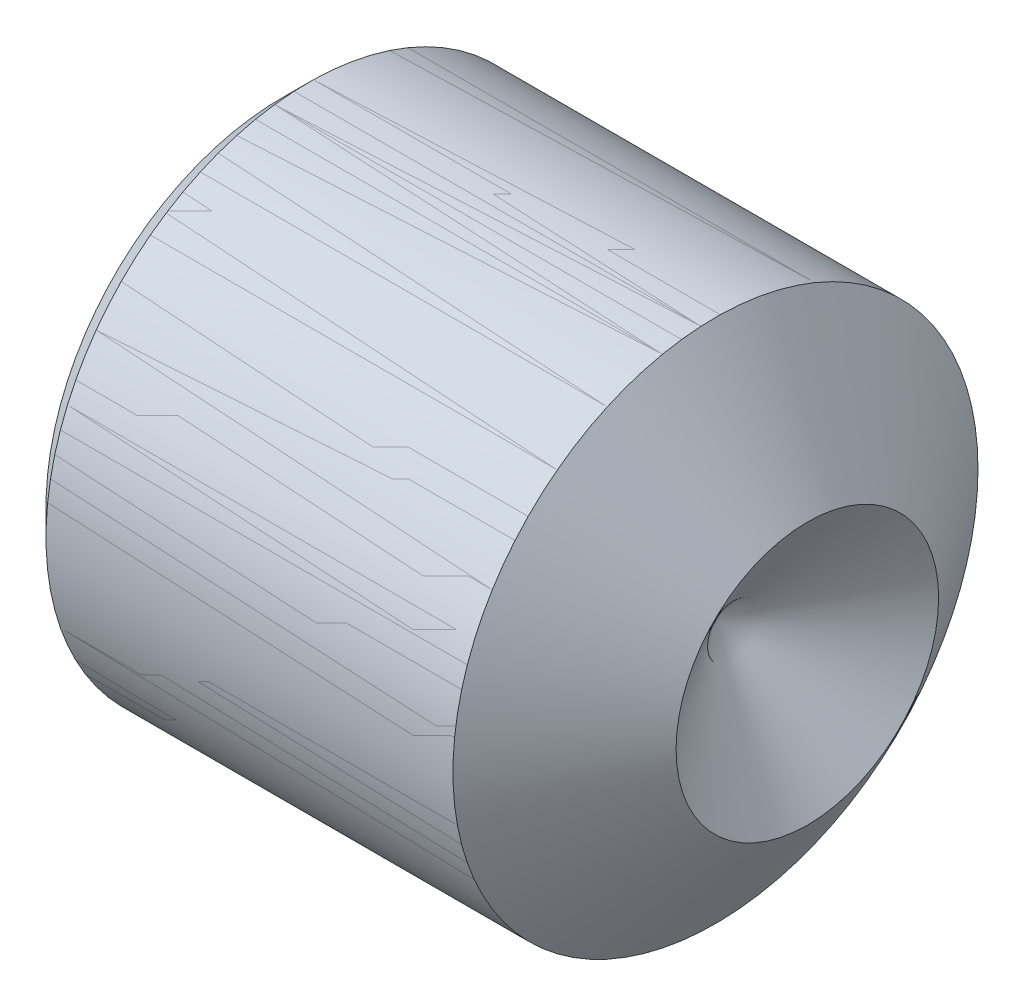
ISO-10303-21;
HEADER;
FILE_DESCRIPTION(('STEP AP214'),'2;1');
FILE_NAME('part.step','',(''),(''),'','','');
FILE_SCHEMA(('AUTOMOTIVE_DESIGN { 1 0 10303 214 1 1 1 1 }'));
ENDSEC;
DATA;
#1=APPLICATION_CONTEXT('core data for automotive mechanical design processes');
#2=APPLICATION_PROTOCOL_DEFINITION('international standard','automotive_design',2000,#1);
#3=PRODUCT_CONTEXT('',#1,'mechanical');
#4=PRODUCT('Part','Part','',(#3));
#5=PRODUCT_RELATED_PRODUCT_CATEGORY('part','',(#4));
#6=PRODUCT_DEFINITION_FORMATION('','',#4);
#7=PRODUCT_DEFINITION_CONTEXT('part definition',#1,'design');
#8=PRODUCT_DEFINITION('design','',#6,#7);
#9=PRODUCT_DEFINITION_SHAPE('','',#8);
#10=(LENGTH_UNIT() NAMED_UNIT(*) SI_UNIT(.MILLI.,.METRE.));
#11=(NAMED_UNIT(*) PLANE_ANGLE_UNIT() SI_UNIT($,.RADIAN.));
#12=(NAMED_UNIT(*) SI_UNIT($,.STERADIAN.) SOLID_ANGLE_UNIT());
#13=UNCERTAINTY_MEASURE_WITH_UNIT(LENGTH_MEASURE(1.E-05),#10,'distance_accuracy_value','');
#14=(GEOMETRIC_REPRESENTATION_CONTEXT(3) GLOBAL_UNCERTAINTY_ASSIGNED_CONTEXT((#13)) GLOBAL_UNIT_ASSIGNED_CONTEXT((#10,
#11,#12)) REPRESENTATION_CONTEXT('',''));
#15=CARTESIAN_POINT('',(0.,0.,0.));
#16=DIRECTION('',(0.,0.,1.));
#17=DIRECTION('',(1.,0.,0.));
#18=AXIS2_PLACEMENT_3D('',#15,#16,#17);
#19=CARTESIAN_POINT('',(-2.4,0.,0.));
#20=DIRECTION('',(1.,0.,0.));
#21=DIRECTION('',(0.,0.,-1.));
#22=AXIS2_PLACEMENT_3D('',#19,#20,#21);
#23=CYLINDRICAL_SURFACE('',#22,2.);
#24=CARTESIAN_POINT('',(1.3,0.,0.));
#25=DIRECTION('',(1.,0.,0.));
#26=DIRECTION('',(0.,0.,-1.));
#27=AXIS2_PLACEMENT_3D('',#24,#25,#26);
#28=CIRCLE('',#27,2.);
#29=CARTESIAN_POINT('',(1.3,0.,-2.));
#30=VERTEX_POINT('',#29);
#31=EDGE_CURVE('P0_E16',#30,#30,#28,.F.);
#32=ORIENTED_EDGE('',*,*,#31,.T.);
#33=EDGE_LOOP('',(#32));
#34=FACE_BOUND('',#33,.T.);
#35=CARTESIAN_POINT('',(-1.8,0.,0.));
#36=DIRECTION('',(1.,0.,0.));
#37=DIRECTION('',(0.,0.,-1.));
#38=AXIS2_PLACEMENT_3D('',#35,#36,#37);
#39=CIRCLE('',#38,2.);
#40=CARTESIAN_POINT('',(-1.8,0.,-2.));
#41=VERTEX_POINT('',#40);
#42=EDGE_CURVE('P0_E10',#41,#41,#39,.T.);
#43=ORIENTED_EDGE('',*,*,#42,.T.);
#44=EDGE_LOOP('',(#43));
#45=FACE_BOUND('',#44,.T.);
#46=ADVANCED_FACE('P0_F15',(#34,#45),#23,.T.);
#47=OPEN_SHELL('',(#46));
#48=SHELL_BASED_SURFACE_MODEL('P0_B1',(#47));
#49=CARTESIAN_POINT('',(0.25,-0.4330127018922,-0.25));
#50=DIRECTION('',(0.894427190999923,-0.38729833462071,-0.223606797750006));
#51=DIRECTION('',(0.397359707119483,0.91766293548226,0.));
#52=AXIS2_PLACEMENT_3D('',#49,#50,#51);
#53=PLANE('',#52);
#54=DIRECTION('',(0.397359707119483,0.91766293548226,0.));
#55=VECTOR('',#54,1.);
#56=CARTESIAN_POINT('',(0.30263157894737,-0.455802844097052,0.));
#57=LINE('',#56,#55);
#58=CARTESIAN_POINT('',(0.,-1.15470053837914,0.));
#59=VERTEX_POINT('',#58);
#60=CARTESIAN_POINT('',(0.499999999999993,0.,0.));
#61=VERTEX_POINT('',#60);
#62=EDGE_CURVE('P1_E114',#59,#61,#57,.T.);
#63=ORIENTED_EDGE('',*,*,#62,.T.);
#64=DIRECTION('',(-0.397359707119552,-0.458831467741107,-0.794719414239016));
#65=VECTOR('',#64,1.);
#66=CARTESIAN_POINT('',(0.500000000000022,0.,0.));
#67=LINE('',#66,#65);
#68=CARTESIAN_POINT('',(0.,-0.577350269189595,-0.999999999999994));
#69=VERTEX_POINT('',#68);
#70=EDGE_CURVE('P1_E95',#61,#69,#67,.T.);
#71=ORIENTED_EDGE('',*,*,#70,.T.);
#72=DIRECTION('',(0.,0.500000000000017,-0.866025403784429));
#73=VECTOR('',#72,1.);
#74=CARTESIAN_POINT('',(0.,-0.8660254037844,-0.5));
#75=LINE('',#74,#73);
#76=EDGE_CURVE('P1_E86',#69,#59,#75,.F.);
#77=ORIENTED_EDGE('',*,*,#76,.T.);
#78=EDGE_LOOP('',(#63,#71,#77));
#79=FACE_BOUND('',#78,.T.);
#80=ADVANCED_FACE('P1_F17',(#79),#53,.F.);
#81=CARTESIAN_POINT('',(0.25,-0.4330127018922,0.25));
#82=DIRECTION('',(0.894427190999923,-0.38729833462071,0.223606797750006));
#83=DIRECTION('',(0.397359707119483,0.91766293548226,0.));
#84=AXIS2_PLACEMENT_3D('',#81,#82,#83);
#85=PLANE('',#84);
#86=DIRECTION('',(0.397359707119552,0.458831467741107,-0.794719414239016));
#87=VECTOR('',#86,1.);
#88=CARTESIAN_POINT('',(0.,-0.5773502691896,0.999999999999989));
#89=LINE('',#88,#87);
#90=CARTESIAN_POINT('',(0.,-0.577350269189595,0.999999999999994));
#91=VERTEX_POINT('',#90);
#92=EDGE_CURVE('P1_E100',#91,#61,#89,.T.);
#93=ORIENTED_EDGE('',*,*,#92,.T.);
#94=ORIENTED_EDGE('',*,*,#62,.F.);
#95=DIRECTION('',(0.,-0.500000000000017,-0.866025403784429));
#96=VECTOR('',#95,1.);
#97=CARTESIAN_POINT('',(0.,-0.8660254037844,0.5));
#98=LINE('',#97,#96);
#99=EDGE_CURVE('P1_E98',#59,#91,#98,.F.);
#100=ORIENTED_EDGE('',*,*,#99,.T.);
#101=EDGE_LOOP('',(#93,#94,#100));
#102=FACE_BOUND('',#101,.T.);
#103=ADVANCED_FACE('P1_F191',(#102),#85,.F.);
#104=CARTESIAN_POINT('',(0.25,0.,-0.5));
#105=DIRECTION('',(0.894427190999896,0.,-0.447213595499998));
#106=DIRECTION('',(-0.447213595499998,0.,-0.894427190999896));
#107=AXIS2_PLACEMENT_3D('',#104,#105,#106);
#108=PLANE('',#107);
#109=ORIENTED_EDGE('',*,*,#70,.F.);
#110=DIRECTION('',(-0.397359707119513,0.458831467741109,-0.794719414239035));
#111=VECTOR('',#110,1.);
#112=CARTESIAN_POINT('',(0.499999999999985,0.,0.));
#113=LINE('',#112,#111);
#114=CARTESIAN_POINT('',(0.,0.577350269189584,-0.999999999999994));
#115=VERTEX_POINT('',#114);
#116=EDGE_CURVE('P1_E164',#61,#115,#113,.T.);
#117=ORIENTED_EDGE('',*,*,#116,.T.);
#118=DIRECTION('',(0.,1.,0.));
#119=VECTOR('',#118,1.);
#120=CARTESIAN_POINT('',(0.,0.,-1.));
#121=LINE('',#120,#119);
#122=EDGE_CURVE('P1_E163',#115,#69,#121,.F.);
#123=ORIENTED_EDGE('',*,*,#122,.T.);
#124=EDGE_LOOP('',(#109,#117,#123));
#125=FACE_BOUND('',#124,.T.);
#126=ADVANCED_FACE('P1_F189',(#125),#108,.F.);
#127=CARTESIAN_POINT('',(-1.,-0.8660254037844,-0.5));
#128=DIRECTION('',(0.,-0.866025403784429,-0.500000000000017));
#129=DIRECTION('',(0.,0.500000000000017,-0.866025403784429));
#130=AXIS2_PLACEMENT_3D('',#127,#128,#129);
#131=PLANE('',#130);
#132=ORIENTED_EDGE('',*,*,#76,.F.);
#133=DIRECTION('',(-1.,0.,0.));
#134=VECTOR('',#133,1.);
#135=CARTESIAN_POINT('',(-1.,-0.5773502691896,-1.));
#136=LINE('',#135,#134);
#137=CARTESIAN_POINT('',(-1.93470053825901,-0.577350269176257,-1.00000000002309));
#138=VERTEX_POINT('',#137);
#139=EDGE_CURVE('P1_E93',#69,#138,#136,.T.);
#140=ORIENTED_EDGE('',*,*,#139,.T.);
#141=CARTESIAN_POINT('',(-1.93470053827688,-1.15470053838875,4.71594179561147E-11));
#142=CARTESIAN_POINT('',(-1.9148758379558,-1.13485670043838,-0.0343705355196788));
#143=CARTESIAN_POINT('',(-1.89621557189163,-1.11468111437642,-0.0693156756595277));
#144=CARTESIAN_POINT('',(-1.86204941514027,-1.07354102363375,-0.140572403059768));
#145=CARTESIAN_POINT('',(-1.84656252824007,-1.05257260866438,-0.176890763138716));
#146=CARTESIAN_POINT('',(-1.82003357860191,-1.01029074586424,-0.250125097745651));
#147=CARTESIAN_POINT('',(-1.8089248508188,-0.988988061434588,-0.28702242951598));
#148=CARTESIAN_POINT('',(-1.79180902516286,-0.94591416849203,-0.361628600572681));
#149=CARTESIAN_POINT('',(-1.78578915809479,-0.924144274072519,-0.399335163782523));
#150=CARTESIAN_POINT('',(-1.78035942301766,-0.88662080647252,-0.464327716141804));
#151=CARTESIAN_POINT('',(-1.77955710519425,-0.870915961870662,-0.491529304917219));
#152=CARTESIAN_POINT('',(-1.78090931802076,-0.839536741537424,-0.545879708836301));
#153=CARTESIAN_POINT('',(-1.78306450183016,-0.823862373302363,-0.573028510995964));
#154=CARTESIAN_POINT('',(-1.79382385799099,-0.777063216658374,-0.654087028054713));
#155=CARTESIAN_POINT('',(-1.80672304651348,-0.746171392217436,-0.707593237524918));
#156=CARTESIAN_POINT('',(-1.83783821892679,-0.691975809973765,-0.801462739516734));
#157=CARTESIAN_POINT('',(-1.85441752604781,-0.668416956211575,-0.842267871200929));
#158=CARTESIAN_POINT('',(-1.89176182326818,-0.62222123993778,-0.922281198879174));
#159=CARTESIAN_POINT('',(-1.91251318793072,-0.599581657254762,-0.961494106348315));
#160=CARTESIAN_POINT('',(-1.93470053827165,-0.577350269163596,-1.000000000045));
#161=B_SPLINE_CURVE_WITH_KNOTS('',3,(#141,#142,#143,#144,#145,#146,#147,#148,#149,#150,#151,
#152,#153,#154,#155,#156,#157,#158,#159,#160),.UNSPECIFIED.,.F.,.F.,(4,2,2,2,2,2,2,2,2,4),(0.,
0.133182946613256,0.267141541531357,0.398973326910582,0.530473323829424,0.624596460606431,
0.718740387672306,0.907081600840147,1.05673041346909,1.20589820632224),.UNSPECIFIED.);
#162=CARTESIAN_POINT('',(-1.93470053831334,-1.15470053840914,-2.11683857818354E-11));
#163=VERTEX_POINT('',#162);
#164=EDGE_CURVE('P1_E20',#163,#138,#161,.T.);
#165=ORIENTED_EDGE('',*,*,#164,.F.);
#166=DIRECTION('',(1.,0.,0.));
#167=VECTOR('',#166,1.);
#168=CARTESIAN_POINT('',(-1.,-1.15470053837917,0.));
#169=LINE('',#168,#167);
#170=EDGE_CURVE('P1_E85',#163,#59,#169,.T.);
#171=ORIENTED_EDGE('',*,*,#170,.T.);
#172=EDGE_LOOP('',(#132,#140,#165,#171));
#173=FACE_BOUND('',#172,.T.);
#174=ADVANCED_FACE('P1_F90',(#173),#131,.F.);
#175=CARTESIAN_POINT('',(-1.,-0.8660254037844,0.5));
#176=DIRECTION('',(0.,-0.866025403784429,0.500000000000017));
#177=DIRECTION('',(0.,-0.500000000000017,-0.866025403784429));
#178=AXIS2_PLACEMENT_3D('',#175,#176,#177);
#179=PLANE('',#178);
#180=ORIENTED_EDGE('',*,*,#99,.F.);
#181=ORIENTED_EDGE('',*,*,#170,.F.);
#182=CARTESIAN_POINT('',(-1.93470053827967,-0.577350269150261,1.00000000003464));
#183=CARTESIAN_POINT('',(-1.91487583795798,-0.597194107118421,0.965629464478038));
#184=CARTESIAN_POINT('',(-1.89621557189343,-0.61736969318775,0.930684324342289));
#185=CARTESIAN_POINT('',(-1.86204941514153,-0.658509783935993,0.859427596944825));
#186=CARTESIAN_POINT('',(-1.84656252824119,-0.679478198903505,0.82310923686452));
#187=CARTESIAN_POINT('',(-1.82003357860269,-0.721760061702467,0.749874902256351));
#188=CARTESIAN_POINT('',(-1.80892485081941,-0.74306274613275,0.712977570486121));
#189=CARTESIAN_POINT('',(-1.79180902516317,-0.786136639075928,0.638371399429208));
#190=CARTESIAN_POINT('',(-1.78578915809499,-0.807906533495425,0.600664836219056));
#191=CARTESIAN_POINT('',(-1.78035942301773,-0.845430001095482,0.535672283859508));
#192=CARTESIAN_POINT('',(-1.77955710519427,-0.86113484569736,0.50847069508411));
#193=CARTESIAN_POINT('',(-1.78090931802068,-0.892514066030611,0.454120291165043));
#194=CARTESIAN_POINT('',(-1.78306450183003,-0.908188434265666,0.426971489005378));
#195=CARTESIAN_POINT('',(-1.79382385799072,-0.954987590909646,0.345912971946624));
#196=CARTESIAN_POINT('',(-1.80672304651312,-0.985879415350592,0.292406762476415));
#197=CARTESIAN_POINT('',(-1.83783821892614,-1.04007499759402,0.198537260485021));
#198=CARTESIAN_POINT('',(-1.85441752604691,-1.06363385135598,0.157732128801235));
#199=CARTESIAN_POINT('',(-1.8917618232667,-1.10982956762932,0.0777188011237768));
#200=CARTESIAN_POINT('',(-1.91251318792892,-1.13246915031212,0.0385058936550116));
#201=CARTESIAN_POINT('',(-1.93470053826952,-1.15470053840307,-4.13038790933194E-11));
#202=B_SPLINE_CURVE_WITH_KNOTS('',3,(#182,#183,#184,#185,#186,#187,#188,#189,#190,#191,#192,
#193,#194,#195,#196,#197,#198,#199,#200,#201),.UNSPECIFIED.,.F.,.F.,(4,2,2,2,2,2,2,2,2,4),(0.,
0.133182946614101,0.26714154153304,0.398973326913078,0.530473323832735,0.624596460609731,
0.718740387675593,0.907081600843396,1.05673041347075,1.20589820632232),.UNSPECIFIED.);
#203=CARTESIAN_POINT('',(-1.93470053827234,-0.577350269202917,1.00000000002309));
#204=VERTEX_POINT('',#203);
#205=EDGE_CURVE('P1_E74',#204,#163,#202,.T.);
#206=ORIENTED_EDGE('',*,*,#205,.F.);
#207=DIRECTION('',(1.,0.,0.));
#208=VECTOR('',#207,1.);
#209=CARTESIAN_POINT('',(-1.,-0.5773502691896,1.));
#210=LINE('',#209,#208);
#211=EDGE_CURVE('P1_E263',#204,#91,#210,.T.);
#212=ORIENTED_EDGE('',*,*,#211,.T.);
#213=EDGE_LOOP('',(#180,#181,#206,#212));
#214=FACE_BOUND('',#213,.T.);
#215=ADVANCED_FACE('P1_F97',(#214),#179,.F.);
#216=CARTESIAN_POINT('',(0.25,0.,0.5));
#217=DIRECTION('',(0.894427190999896,0.,0.447213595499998));
#218=DIRECTION('',(0.447213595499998,0.,-0.894427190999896));
#219=AXIS2_PLACEMENT_3D('',#216,#217,#218);
#220=PLANE('',#219);
#221=DIRECTION('',(0.397359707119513,-0.458831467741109,-0.794719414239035));
#222=VECTOR('',#221,1.);
#223=CARTESIAN_POINT('',(0.,0.577350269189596,0.999999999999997));
#224=LINE('',#223,#222);
#225=CARTESIAN_POINT('',(0.,0.577350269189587,0.99999999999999));
#226=VERTEX_POINT('',#225);
#227=EDGE_CURVE('P1_E255',#226,#61,#224,.T.);
#228=ORIENTED_EDGE('',*,*,#227,.T.);
#229=ORIENTED_EDGE('',*,*,#92,.F.);
#230=DIRECTION('',(0.,1.,0.));
#231=VECTOR('',#230,1.);
#232=CARTESIAN_POINT('',(0.,0.,1.));
#233=LINE('',#232,#231);
#234=EDGE_CURVE('P1_E260',#91,#226,#233,.T.);
#235=ORIENTED_EDGE('',*,*,#234,.T.);
#236=EDGE_LOOP('',(#228,#229,#235));
#237=FACE_BOUND('',#236,.T.);
#238=ADVANCED_FACE('P1_F180',(#237),#220,.F.);
#239=CARTESIAN_POINT('',(0.25,0.4330127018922,-0.25));
#240=DIRECTION('',(0.894427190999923,0.38729833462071,-0.223606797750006));
#241=DIRECTION('',(-0.397359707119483,0.91766293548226,0.));
#242=AXIS2_PLACEMENT_3D('',#239,#240,#241);
#243=PLANE('',#242);
#244=ORIENTED_EDGE('',*,*,#116,.F.);
#245=DIRECTION('',(-0.397359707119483,0.91766293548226,0.));
#246=VECTOR('',#245,1.);
#247=CARTESIAN_POINT('',(0.302631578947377,0.455802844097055,0.));
#248=LINE('',#247,#246);
#249=CARTESIAN_POINT('',(0.,1.15470053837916,0.));
#250=VERTEX_POINT('',#249);
#251=EDGE_CURVE('P1_E253',#61,#250,#248,.T.);
#252=ORIENTED_EDGE('',*,*,#251,.T.);
#253=DIRECTION('',(0.,0.500000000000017,0.866025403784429));
#254=VECTOR('',#253,1.);
#255=CARTESIAN_POINT('',(0.,0.8660254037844,-0.5));
#256=LINE('',#255,#254);
#257=EDGE_CURVE('P1_E242',#250,#115,#256,.F.);
#258=ORIENTED_EDGE('',*,*,#257,.T.);
#259=EDGE_LOOP('',(#244,#252,#258));
#260=FACE_BOUND('',#259,.T.);
#261=ADVANCED_FACE('P1_F174',(#260),#243,.F.);
#262=CARTESIAN_POINT('',(-1.,0.,-1.));
#263=DIRECTION('',(0.,0.,-1.));
#264=DIRECTION('',(-1.,0.,0.));
#265=AXIS2_PLACEMENT_3D('',#262,#263,#264);
#266=PLANE('',#265);
#267=ORIENTED_EDGE('',*,*,#122,.F.);
#268=DIRECTION('',(1.,0.,0.));
#269=VECTOR('',#268,1.);
#270=CARTESIAN_POINT('',(-1.,0.577350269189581,-0.999999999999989));
#271=LINE('',#270,#269);
#272=CARTESIAN_POINT('',(-1.93470053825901,0.577350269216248,-0.999999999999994));
#273=VERTEX_POINT('',#272);
#274=EDGE_CURVE('P1_E237',#115,#273,#271,.F.);
#275=ORIENTED_EDGE('',*,*,#274,.T.);
#276=CARTESIAN_POINT('',(-1.93470053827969,-0.577350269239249,-0.999999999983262));
#277=CARTESIAN_POINT('',(-1.91487583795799,-0.537662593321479,-0.999999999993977));
#278=CARTESIAN_POINT('',(-1.89621557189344,-0.497311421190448,-0.999999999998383));
#279=CARTESIAN_POINT('',(-1.86204941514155,-0.415031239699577,-1.00000000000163));
#280=CARTESIAN_POINT('',(-1.84656252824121,-0.373094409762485,-1.00000000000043));
#281=CARTESIAN_POINT('',(-1.82003357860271,-0.288530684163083,-0.999999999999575));
#282=CARTESIAN_POINT('',(-1.80892485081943,-0.245925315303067,-0.999999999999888));
#283=CARTESIAN_POINT('',(-1.7918090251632,-0.159777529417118,-1.00000000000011));
#284=CARTESIAN_POINT('',(-1.78578915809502,-0.11623774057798,-1.00000000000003));
#285=CARTESIAN_POINT('',(-1.78035942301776,-0.0411908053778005,-0.999999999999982));
#286=CARTESIAN_POINT('',(-1.7795571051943,-0.00978111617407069,-0.999999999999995));
#287=CARTESIAN_POINT('',(-1.78090931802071,0.0529773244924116,-1.00000000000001));
#288=CARTESIAN_POINT('',(-1.78306450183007,0.0843260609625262,-1.));
#289=CARTESIAN_POINT('',(-1.79382385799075,0.177924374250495,-0.999999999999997));
#290=CARTESIAN_POINT('',(-1.80672304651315,0.239708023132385,-0.999999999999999));
#291=CARTESIAN_POINT('',(-1.83783821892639,0.348099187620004,-1.));
#292=CARTESIAN_POINT('',(-1.85441752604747,0.395216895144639,-1.));
#293=CARTESIAN_POINT('',(-1.89176182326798,0.48760832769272,-1.));
#294=CARTESIAN_POINT('',(-1.91251318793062,0.532887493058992,-0.999999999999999));
#295=CARTESIAN_POINT('',(-1.93470053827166,0.577350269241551,-1.));
#296=B_SPLINE_CURVE_WITH_KNOTS('',3,(#276,#277,#278,#279,#280,#281,#282,#283,#284,#285,#286,
#287,#288,#289,#290,#291,#292,#293,#294,#295),.UNSPECIFIED.,.F.,.F.,(4,2,2,2,2,2,2,2,2,4),(0.,
0.133182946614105,0.267141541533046,0.398973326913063,0.530473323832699,0.624596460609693,
0.718740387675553,0.90708160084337,1.05673041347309,1.205898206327),.UNSPECIFIED.);
#297=EDGE_CURVE('P1_E158',#138,#273,#296,.T.);
#298=ORIENTED_EDGE('',*,*,#297,.F.);
#299=ORIENTED_EDGE('',*,*,#139,.F.);
#300=EDGE_LOOP('',(#267,#275,#298,#299));
#301=FACE_BOUND('',#300,.T.);
#302=ADVANCED_FACE('P1_F169',(#301),#266,.F.);
#303=CARTESIAN_POINT('',(-1.,0.,1.));
#304=DIRECTION('',(0.,0.,1.));
#305=DIRECTION('',(1.,0.,0.));
#306=AXIS2_PLACEMENT_3D('',#303,#304,#305);
#307=PLANE('',#306);
#308=ORIENTED_EDGE('',*,*,#234,.F.);
#309=ORIENTED_EDGE('',*,*,#211,.F.);
#310=CARTESIAN_POINT('',(-1.93470053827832,0.577350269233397,0.99999999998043));
#311=CARTESIAN_POINT('',(-1.91487583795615,0.537662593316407,0.999999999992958));
#312=CARTESIAN_POINT('',(-1.8962155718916,0.497311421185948,0.999999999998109));
#313=CARTESIAN_POINT('',(-1.86204941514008,0.415031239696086,1.0000000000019));
#314=CARTESIAN_POINT('',(-1.84656252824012,0.373094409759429,1.00000000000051));
#315=CARTESIAN_POINT('',(-1.82003357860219,0.288530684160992,0.999999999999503));
#316=CARTESIAN_POINT('',(-1.80892485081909,0.245925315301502,0.999999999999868));
#317=CARTESIAN_POINT('',(-1.79180902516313,0.159777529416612,1.00000000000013));
#318=CARTESIAN_POINT('',(-1.78578915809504,0.116237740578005,1.00000000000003));
#319=CARTESIAN_POINT('',(-1.78035942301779,0.0411908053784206,0.999999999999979));
#320=CARTESIAN_POINT('',(-1.77955710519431,0.00978111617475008,0.999999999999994));
#321=CARTESIAN_POINT('',(-1.78090931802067,-0.0529773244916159,1.00000000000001));
#322=CARTESIAN_POINT('',(-1.78306450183,-0.0843260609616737,1.));
#323=CARTESIAN_POINT('',(-1.79382385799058,-0.177924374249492,0.999999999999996));
#324=CARTESIAN_POINT('',(-1.8067230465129,-0.239708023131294,0.999999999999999));
#325=CARTESIAN_POINT('',(-1.83783821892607,-0.348099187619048,1.));
#326=CARTESIAN_POINT('',(-1.85441752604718,-0.395216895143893,1.));
#327=CARTESIAN_POINT('',(-1.89176182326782,-0.487608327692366,1.));
#328=CARTESIAN_POINT('',(-1.91251318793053,-0.532887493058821,0.999999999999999));
#329=CARTESIAN_POINT('',(-1.93470053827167,-0.577350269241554,1.));
#330=B_SPLINE_CURVE_WITH_KNOTS('',3,(#310,#311,#312,#313,#314,#315,#316,#317,#318,#319,#320,
#321,#322,#323,#324,#325,#326,#327,#328,#329),.UNSPECIFIED.,.F.,.F.,(4,2,2,2,2,2,2,2,2,4),(0.,
0.133182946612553,0.267141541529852,0.398973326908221,0.530473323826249,0.624596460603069,
0.718740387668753,0.907081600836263,1.05673041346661,1.20589820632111),.UNSPECIFIED.);
#331=CARTESIAN_POINT('',(-1.9347005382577,0.577350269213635,0.999999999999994));
#332=VERTEX_POINT('',#331);
#333=EDGE_CURVE('P1_E80',#332,#204,#330,.T.);
#334=ORIENTED_EDGE('',*,*,#333,.F.);
#335=DIRECTION('',(1.,0.,0.));
#336=VECTOR('',#335,1.);
#337=CARTESIAN_POINT('',(-1.,0.577350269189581,0.999999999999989));
#338=LINE('',#337,#336);
#339=EDGE_CURVE('P1_E234',#332,#226,#338,.T.);
#340=ORIENTED_EDGE('',*,*,#339,.T.);
#341=EDGE_LOOP('',(#308,#309,#334,#340));
#342=FACE_BOUND('',#341,.T.);
#343=ADVANCED_FACE('P1_F173',(#342),#307,.F.);
#344=CARTESIAN_POINT('',(0.25,0.4330127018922,0.25));
#345=DIRECTION('',(0.894427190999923,0.38729833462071,0.223606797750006));
#346=DIRECTION('',(-0.397359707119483,0.91766293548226,0.));
#347=AXIS2_PLACEMENT_3D('',#344,#345,#346);
#348=PLANE('',#347);
#349=ORIENTED_EDGE('',*,*,#251,.F.);
#350=ORIENTED_EDGE('',*,*,#227,.F.);
#351=DIRECTION('',(0.,-0.500000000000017,0.866025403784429));
#352=VECTOR('',#351,1.);
#353=CARTESIAN_POINT('',(0.,0.8660254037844,0.5));
#354=LINE('',#353,#352);
#355=EDGE_CURVE('P1_E231',#226,#250,#354,.F.);
#356=ORIENTED_EDGE('',*,*,#355,.T.);
#357=EDGE_LOOP('',(#349,#350,#356));
#358=FACE_BOUND('',#357,.T.);
#359=ADVANCED_FACE('P1_F289',(#358),#348,.F.);
#360=CARTESIAN_POINT('',(-1.,0.8660254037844,-0.5));
#361=DIRECTION('',(0.,0.866025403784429,-0.500000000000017));
#362=DIRECTION('',(0.,0.500000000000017,0.866025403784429));
#363=AXIS2_PLACEMENT_3D('',#360,#361,#362);
#364=PLANE('',#363);
#365=ORIENTED_EDGE('',*,*,#257,.F.);
#366=DIRECTION('',(1.,0.,0.));
#367=VECTOR('',#366,1.);
#368=CARTESIAN_POINT('',(-1.,1.15470053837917,0.));
#369=LINE('',#368,#367);
#370=CARTESIAN_POINT('',(-1.93470053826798,1.15470053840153,0.));
#371=VERTEX_POINT('',#370);
#372=EDGE_CURVE('P1_E134',#250,#371,#369,.F.);
#373=ORIENTED_EDGE('',*,*,#372,.T.);
#374=CARTESIAN_POINT('',(-1.93470053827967,0.577350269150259,-1.00000000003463));
#375=CARTESIAN_POINT('',(-1.91487583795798,0.597194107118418,-0.96562946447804));
#376=CARTESIAN_POINT('',(-1.89621557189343,0.617369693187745,-0.930684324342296));
#377=CARTESIAN_POINT('',(-1.86204941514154,0.658509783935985,-0.85942759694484));
#378=CARTESIAN_POINT('',(-1.8465625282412,0.679478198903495,-0.823109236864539));
#379=CARTESIAN_POINT('',(-1.8200335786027,0.721760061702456,-0.74987490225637));
#380=CARTESIAN_POINT('',(-1.80892485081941,0.743062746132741,-0.712977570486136));
#381=CARTESIAN_POINT('',(-1.79180902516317,0.786136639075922,-0.638371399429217));
#382=CARTESIAN_POINT('',(-1.78578915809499,0.807906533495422,-0.600664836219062));
#383=CARTESIAN_POINT('',(-1.78035942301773,0.845430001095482,-0.535672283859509));
#384=CARTESIAN_POINT('',(-1.77955710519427,0.86113484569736,-0.50847069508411));
#385=CARTESIAN_POINT('',(-1.78090931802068,0.892514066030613,-0.45412029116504));
#386=CARTESIAN_POINT('',(-1.78306450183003,0.908188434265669,-0.426971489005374));
#387=CARTESIAN_POINT('',(-1.79382385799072,0.954987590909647,-0.345912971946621));
#388=CARTESIAN_POINT('',(-1.80672304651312,0.985879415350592,-0.292406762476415));
#389=CARTESIAN_POINT('',(-1.83783821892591,1.04007499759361,-0.198537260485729));
#390=CARTESIAN_POINT('',(-1.85441752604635,1.06363385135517,-0.157732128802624));
#391=CARTESIAN_POINT('',(-1.89176182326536,1.10982956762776,-0.0777188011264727));
#392=CARTESIAN_POINT('',(-1.91251318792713,1.1324691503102,-0.0385058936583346));
#393=CARTESIAN_POINT('',(-1.93470053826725,1.15470053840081,3.7376755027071E-11));
#394=B_SPLINE_CURVE_WITH_KNOTS('',3,(#374,#375,#376,#377,#378,#379,#380,#381,#382,#383,#384,
#385,#386,#387,#388,#389,#390,#391,#392,#393),.UNSPECIFIED.,.F.,.F.,(4,2,2,2,2,2,2,2,2,4),(0.,
0.133182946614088,0.267141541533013,0.398973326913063,0.530473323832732,0.624596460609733,
0.718740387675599,0.907081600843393,1.05673041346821,1.20589820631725),.UNSPECIFIED.);
#395=EDGE_CURVE('P1_E135',#273,#371,#394,.T.);
#396=ORIENTED_EDGE('',*,*,#395,.F.);
#397=ORIENTED_EDGE('',*,*,#274,.F.);
#398=EDGE_LOOP('',(#365,#373,#396,#397));
#399=FACE_BOUND('',#398,.T.);
#400=ADVANCED_FACE('P1_F295',(#399),#364,.F.);
#401=CARTESIAN_POINT('',(-1.,0.8660254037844,0.5));
#402=DIRECTION('',(0.,0.866025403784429,0.500000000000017));
#403=DIRECTION('',(0.,-0.500000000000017,0.866025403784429));
#404=AXIS2_PLACEMENT_3D('',#401,#402,#403);
#405=PLANE('',#404);
#406=ORIENTED_EDGE('',*,*,#355,.F.);
#407=ORIENTED_EDGE('',*,*,#339,.F.);
#408=CARTESIAN_POINT('',(-1.9347005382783,0.577350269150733,1.00000000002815));
#409=CARTESIAN_POINT('',(-1.91487583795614,0.597194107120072,0.965629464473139));
#410=CARTESIAN_POINT('',(-1.89621557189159,0.617369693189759,0.930684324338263));
#411=CARTESIAN_POINT('',(-1.86204941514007,0.658509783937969,0.859427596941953));
#412=CARTESIAN_POINT('',(-1.84656252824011,0.679478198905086,0.823109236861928));
#413=CARTESIAN_POINT('',(-1.82003357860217,0.72176006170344,0.749874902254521));
#414=CARTESIAN_POINT('',(-1.80892485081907,0.743062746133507,0.712977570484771));
#415=CARTESIAN_POINT('',(-1.7918090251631,0.786136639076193,0.638371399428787));
#416=CARTESIAN_POINT('',(-1.78578915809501,0.807906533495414,0.600664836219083));
#417=CARTESIAN_POINT('',(-1.78035942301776,0.845430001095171,0.535672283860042));
#418=CARTESIAN_POINT('',(-1.77955710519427,0.861134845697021,0.508470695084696));
#419=CARTESIAN_POINT('',(-1.78090931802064,0.892514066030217,0.454120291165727));
#420=CARTESIAN_POINT('',(-1.78306450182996,0.908188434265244,0.42697148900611));
#421=CARTESIAN_POINT('',(-1.79382385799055,0.954987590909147,0.345912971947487));
#422=CARTESIAN_POINT('',(-1.80672304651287,0.985879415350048,0.292406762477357));
#423=CARTESIAN_POINT('',(-1.83783821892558,1.04007499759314,0.198537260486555));
#424=CARTESIAN_POINT('',(-1.85441752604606,1.0636338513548,0.157732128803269));
#425=CARTESIAN_POINT('',(-1.8917618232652,1.10982956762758,0.0777188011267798));
#426=CARTESIAN_POINT('',(-1.91251318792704,1.13246915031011,0.0385058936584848));
#427=CARTESIAN_POINT('',(-1.93470053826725,1.15470053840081,-3.73766403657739E-11));
#428=B_SPLINE_CURVE_WITH_KNOTS('',3,(#408,#409,#410,#411,#412,#413,#414,#415,#416,#417,#418,
#419,#420,#421,#422,#423,#424,#425,#426,#427),.UNSPECIFIED.,.F.,.F.,(4,2,2,2,2,2,2,2,2,4),(0.,
0.133182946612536,0.267141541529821,0.398973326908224,0.530473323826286,0.624596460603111,
0.718740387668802,0.907081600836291,1.05673041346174,1.20589820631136),.UNSPECIFIED.);
#429=EDGE_CURVE('P1_E127',#332,#371,#428,.T.);
#430=ORIENTED_EDGE('',*,*,#429,.T.);
#431=ORIENTED_EDGE('',*,*,#372,.F.);
#432=EDGE_LOOP('',(#406,#407,#430,#431));
#433=FACE_BOUND('',#432,.T.);
#434=ADVANCED_FACE('P1_F141',(#433),#405,.F.);
#435=CARTESIAN_POINT('',(-1.99999999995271,0.,0.));
#436=DIRECTION('',(-1.,0.,0.));
#437=DIRECTION('',(0.,0.,1.));
#438=AXIS2_PLACEMENT_3D('',#435,#436,#437);
#439=CONICAL_SURFACE('',#438,1.22000000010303,0.785398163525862);
#440=ORIENTED_EDGE('',*,*,#205,.T.);
#441=ORIENTED_EDGE('',*,*,#164,.T.);
#442=ORIENTED_EDGE('',*,*,#297,.T.);
#443=ORIENTED_EDGE('',*,*,#395,.T.);
#444=ORIENTED_EDGE('',*,*,#429,.F.);
#445=ORIENTED_EDGE('',*,*,#333,.T.);
#446=EDGE_LOOP('',(#440,#441,#442,#443,#444,#445));
#447=FACE_BOUND('',#446,.T.);
#448=CARTESIAN_POINT('',(-1.99999999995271,0.,0.));
#449=DIRECTION('',(-1.,0.,0.));
#450=DIRECTION('',(0.,0.,1.));
#451=AXIS2_PLACEMENT_3D('',#448,#449,#450);
#452=CIRCLE('',#451,1.22000000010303);
#453=CARTESIAN_POINT('',(-1.99999999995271,0.,1.22000000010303));
#454=VERTEX_POINT('',#453);
#455=EDGE_CURVE('P1_E124',#454,#454,#452,.T.);
#456=ORIENTED_EDGE('',*,*,#455,.T.);
#457=EDGE_LOOP('',(#456));
#458=FACE_BOUND('',#457,.T.);
#459=ADVANCED_FACE('P1_F76',(#447,#458),#439,.F.);
#460=CARTESIAN_POINT('',(-2.,0.,0.));
#461=DIRECTION('',(1.,0.,0.));
#462=DIRECTION('',(0.,0.,-1.));
#463=AXIS2_PLACEMENT_3D('',#460,#461,#462);
#464=PLANE('',#463);
#465=ORIENTED_EDGE('',*,*,#455,.F.);
#466=EDGE_LOOP('',(#465));
#467=FACE_BOUND('',#466,.T.);
#468=CARTESIAN_POINT('',(-1.99999999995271,0.,0.));
#469=DIRECTION('',(1.,0.,0.));
#470=DIRECTION('',(0.,0.,-1.));
#471=AXIS2_PLACEMENT_3D('',#468,#469,#470);
#472=CIRCLE('',#471,1.80000000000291);
#473=CARTESIAN_POINT('',(-1.99999999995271,0.,-1.80000000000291));
#474=VERTEX_POINT('',#473);
#475=EDGE_CURVE('P1_E120',#474,#474,#472,.T.);
#476=ORIENTED_EDGE('',*,*,#475,.F.);
#477=EDGE_LOOP('',(#476));
#478=FACE_BOUND('',#477,.T.);
#479=ADVANCED_FACE('P1_F146',(#467,#478),#464,.F.);
#480=CARTESIAN_POINT('',(1.99999999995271,0.,0.));
#481=DIRECTION('',(1.,0.,0.));
#482=DIRECTION('',(0.,0.,-1.));
#483=AXIS2_PLACEMENT_3D('',#480,#481,#482);
#484=CONICAL_SURFACE('',#483,0.99999999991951,0.960070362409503);
#485=CARTESIAN_POINT('',(1.30000000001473,1.4210854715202E-10,0.));
#486=VERTEX_POINT('',#485);
#487=VERTEX_LOOP('',#486);
#488=FACE_BOUND('',#487,.T.);
#489=CARTESIAN_POINT('',(2.00000000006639,0.,0.));
#490=DIRECTION('',(-1.,0.,0.));
#491=DIRECTION('',(0.,1.,0.));
#492=AXIS2_PLACEMENT_3D('',#489,#490,#491);
#493=CIRCLE('',#492,0.999999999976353);
#494=CARTESIAN_POINT('',(2.00000000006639,0.999999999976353,0.));
#495=VERTEX_POINT('',#494);
#496=EDGE_CURVE('P1_E123',#495,#495,#493,.T.);
#497=ORIENTED_EDGE('',*,*,#496,.F.);
#498=EDGE_LOOP('',(#497));
#499=FACE_BOUND('',#498,.T.);
#500=ADVANCED_FACE('P1_F215',(#488,#499),#484,.F.);
#501=CARTESIAN_POINT('',(-1.8000000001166,0.,0.));
#502=DIRECTION('',(1.,0.,0.));
#503=DIRECTION('',(0.,0.,-1.));
#504=AXIS2_PLACEMENT_3D('',#501,#502,#503);
#505=CONICAL_SURFACE('',#504,1.99999999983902,0.785398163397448);
#506=CARTESIAN_POINT('',(-1.8,0.,0.));
#507=DIRECTION('',(1.,0.,0.));
#508=DIRECTION('',(0.,0.,-1.));
#509=AXIS2_PLACEMENT_3D('',#506,#507,#508);
#510=CIRCLE('',#509,2.);
#511=CARTESIAN_POINT('',(-1.8,0.,-2.));
#512=VERTEX_POINT('',#511);
#513=EDGE_CURVE('P1_E31',#512,#512,#510,.T.);
#514=ORIENTED_EDGE('',*,*,#513,.F.);
#515=EDGE_LOOP('',(#514));
#516=FACE_BOUND('',#515,.T.);
#517=ORIENTED_EDGE('',*,*,#475,.T.);
#518=EDGE_LOOP('',(#517));
#519=FACE_BOUND('',#518,.T.);
#520=ADVANCED_FACE('P1_F209',(#516,#519),#505,.T.);
#521=CARTESIAN_POINT('',(1.30000000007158,0.,0.));
#522=DIRECTION('',(-1.,0.,0.));
#523=DIRECTION('',(0.,0.,1.));
#524=AXIS2_PLACEMENT_3D('',#521,#522,#523);
#525=CONICAL_SURFACE('',#524,2.00000000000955,0.960070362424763);
#526=ORIENTED_EDGE('',*,*,#496,.T.);
#527=EDGE_LOOP('',(#526));
#528=FACE_BOUND('',#527,.T.);
#529=CARTESIAN_POINT('',(1.3,0.,0.));
#530=DIRECTION('',(1.,0.,0.));
#531=DIRECTION('',(0.,0.,-1.));
#532=AXIS2_PLACEMENT_3D('',#529,#530,#531);
#533=CIRCLE('',#532,2.);
#534=CARTESIAN_POINT('',(1.3,0.,-2.));
#535=VERTEX_POINT('',#534);
#536=EDGE_CURVE('P1_E11',#535,#535,#533,.F.);
#537=ORIENTED_EDGE('',*,*,#536,.F.);
#538=EDGE_LOOP('',(#537));
#539=FACE_BOUND('',#538,.T.);
#540=ADVANCED_FACE('P1_F203',(#528,#539),#525,.T.);
#541=CARTESIAN_POINT('',(-2.2,0.,0.));
#542=DIRECTION('',(1.,0.,0.));
#543=DIRECTION('',(0.,0.,-1.));
#544=AXIS2_PLACEMENT_3D('',#541,#542,#543);
#545=CYLINDRICAL_SURFACE('',#544,2.);
#546=ORIENTED_EDGE('',*,*,#536,.T.);
#547=EDGE_LOOP('',(#546));
#548=FACE_BOUND('',#547,.T.);
#549=ORIENTED_EDGE('',*,*,#513,.T.);
#550=EDGE_LOOP('',(#549));
#551=FACE_BOUND('',#550,.T.);
#552=ADVANCED_FACE('P1_F201',(#548,#551),#545,.T.);
#553=CLOSED_SHELL('',(#80,#103,#126,#174,#215,#238,#261,#302,#343,#359,#400,#434,#459,#479,#500,
#520,#540,#552));
#554=MANIFOLD_SOLID_BREP('P1_B1',#553);
#555=ADVANCED_BREP_SHAPE_REPRESENTATION('',(#18,#554),#14);
#556=MANIFOLD_SURFACE_SHAPE_REPRESENTATION('',(#18,#48),#14);
#557=SHAPE_REPRESENTATION('',(#18),#14);
#558=SHAPE_DEFINITION_REPRESENTATION(#9,#557);
#559=SHAPE_REPRESENTATION_RELATIONSHIP('','',#557,#555);
#560=SHAPE_REPRESENTATION_RELATIONSHIP('','',#557,#556);
ENDSEC;
END-ISO-10303-21;
